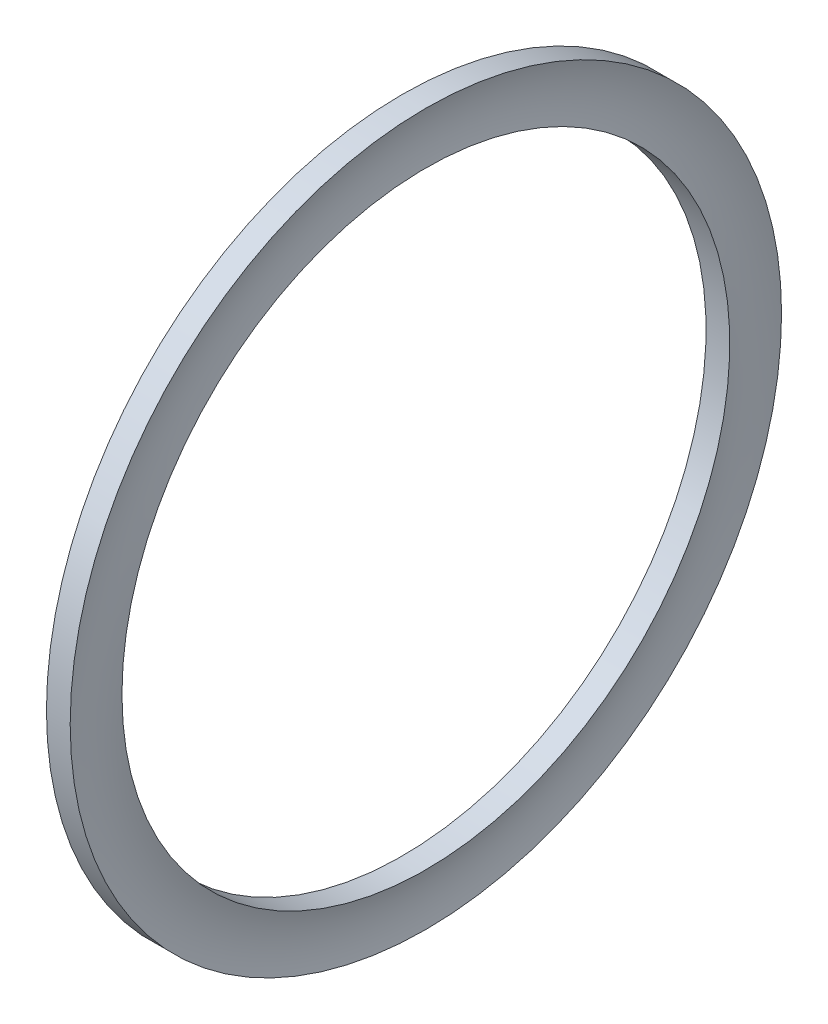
from build123d import *


with BuildPart() as part:
    # Sketch1 → Revolve1 (revolve)
    with BuildSketch(Plane.XY, mode=Mode.PRIVATE) as revolve1_sk:
        with BuildLine():
            Line((0, 16.256), (1.27, 16.256))
            ThreePointArc((1.27, 16.256), (1.047610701, 17.6403), (1.27, 19.0246))
            Line((1.27, 19.0246), (0, 19.0246))
            Line((0, 19.0246), (0, 16.256))
        make_face()
    revolve(revolve1_sk.sketch.rotate(Axis((0, 0, 0), (1, 0, 0)), 90), axis=Axis((0, 0, 0), (1, 0, 0)))


solid = part.part
